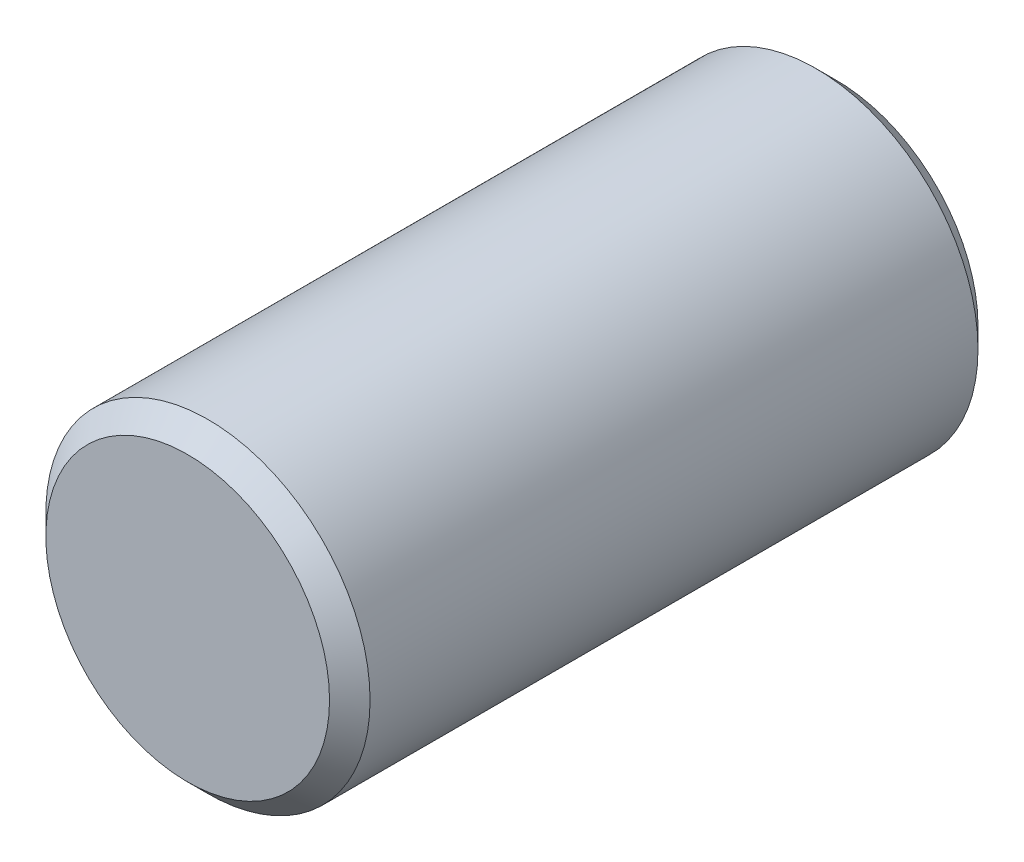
from build123d import *


with BuildPart() as part:
    # Sketch1 → Revolve1 (revolve)
    with BuildSketch(Plane(origin=(0, 0, 0), x_dir=(0, 0, -1), z_dir=(1, 0, 0)), mode=Mode.PRIVATE) as revolve1_sk:
        Polygon((0, 0), (8, 0), (8, 1.749986), (7.749986, 2), (0.250014, 2), (0, 1.749986), align=None)
    revolve(revolve1_sk.sketch.rotate(Axis((0, 0, -10.674691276), (0, 0, -1)), 90), axis=Axis((0, 0, -10.674691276), (0, 0, -1)))


solid = part.part
